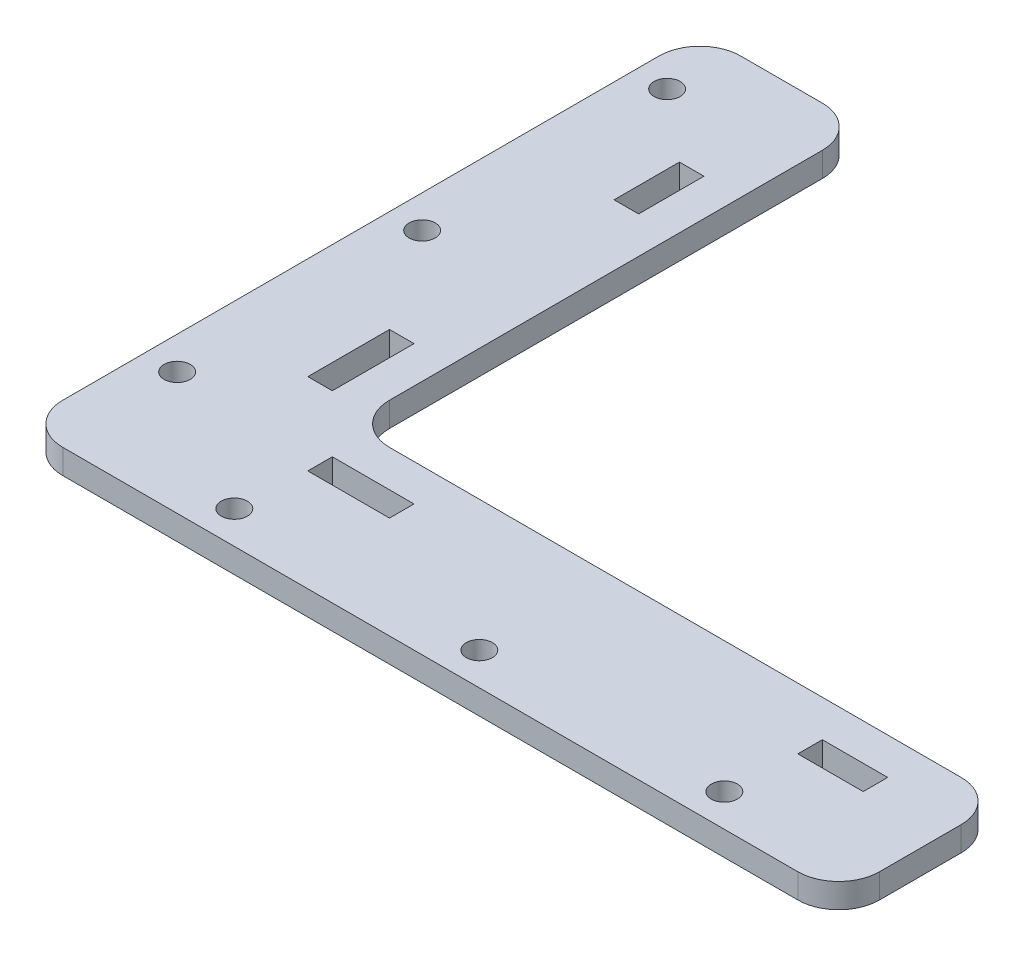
ISO-10303-21;
HEADER;
FILE_DESCRIPTION(('STEP AP214'),'2;1');
FILE_NAME('part.step','',(''),(''),'','','');
FILE_SCHEMA(('AUTOMOTIVE_DESIGN { 1 0 10303 214 1 1 1 1 }'));
ENDSEC;
DATA;
#1=APPLICATION_CONTEXT('core data for automotive mechanical design processes');
#2=APPLICATION_PROTOCOL_DEFINITION('international standard','automotive_design',2000,#1);
#3=PRODUCT_CONTEXT('',#1,'mechanical');
#4=PRODUCT('Part','Part','',(#3));
#5=PRODUCT_RELATED_PRODUCT_CATEGORY('part','',(#4));
#6=PRODUCT_DEFINITION_FORMATION('','',#4);
#7=PRODUCT_DEFINITION_CONTEXT('part definition',#1,'design');
#8=PRODUCT_DEFINITION('design','',#6,#7);
#9=PRODUCT_DEFINITION_SHAPE('','',#8);
#10=(LENGTH_UNIT() NAMED_UNIT(*) SI_UNIT(.MILLI.,.METRE.));
#11=(NAMED_UNIT(*) PLANE_ANGLE_UNIT() SI_UNIT($,.RADIAN.));
#12=(NAMED_UNIT(*) SI_UNIT($,.STERADIAN.) SOLID_ANGLE_UNIT());
#13=UNCERTAINTY_MEASURE_WITH_UNIT(LENGTH_MEASURE(1.E-05),#10,'distance_accuracy_value','');
#14=(GEOMETRIC_REPRESENTATION_CONTEXT(3) GLOBAL_UNCERTAINTY_ASSIGNED_CONTEXT((#13)) GLOBAL_UNIT_ASSIGNED_CONTEXT((#10,
#11,#12)) REPRESENTATION_CONTEXT('',''));
#15=CARTESIAN_POINT('',(0.,0.,0.));
#16=DIRECTION('',(0.,0.,1.));
#17=DIRECTION('',(1.,0.,0.));
#18=AXIS2_PLACEMENT_3D('',#15,#16,#17);
#19=CARTESIAN_POINT('',(-16.,0.,5.));
#20=DIRECTION('',(0.,1.,0.));
#21=DIRECTION('',(0.,0.,1.));
#22=AXIS2_PLACEMENT_3D('',#19,#20,#21);
#23=CYLINDRICAL_SURFACE('',#22,1.6);
#24=CARTESIAN_POINT('',(-16.,0.,5.));
#25=DIRECTION('',(0.,1.,0.));
#26=DIRECTION('',(0.,0.,1.));
#27=AXIS2_PLACEMENT_3D('',#24,#25,#26);
#28=CIRCLE('',#27,1.6);
#29=CARTESIAN_POINT('',(-16.,0.,6.6));
#30=VERTEX_POINT('',#29);
#31=EDGE_CURVE('E41',#30,#30,#28,.T.);
#32=ORIENTED_EDGE('',*,*,#31,.F.);
#33=EDGE_LOOP('',(#32));
#34=FACE_BOUND('',#33,.T.);
#35=CARTESIAN_POINT('',(-16.,3.,5.));
#36=DIRECTION('',(0.,1.,0.));
#37=DIRECTION('',(0.,0.,1.));
#38=AXIS2_PLACEMENT_3D('',#35,#36,#37);
#39=CIRCLE('',#38,1.6);
#40=CARTESIAN_POINT('',(-16.,3.,6.6));
#41=VERTEX_POINT('',#40);
#42=EDGE_CURVE('E11',#41,#41,#39,.T.);
#43=ORIENTED_EDGE('',*,*,#42,.T.);
#44=EDGE_LOOP('',(#43));
#45=FACE_BOUND('',#44,.T.);
#46=ADVANCED_FACE('F34',(#34,#45),#23,.F.);
#47=CARTESIAN_POINT('',(2.,0.,16.));
#48=DIRECTION('',(0.,1.,0.));
#49=DIRECTION('',(0.,0.,1.));
#50=AXIS2_PLACEMENT_3D('',#47,#48,#49);
#51=CYLINDRICAL_SURFACE('',#50,1.6);
#52=CARTESIAN_POINT('',(2.,0.,16.));
#53=DIRECTION('',(0.,1.,0.));
#54=DIRECTION('',(0.,0.,1.));
#55=AXIS2_PLACEMENT_3D('',#52,#53,#54);
#56=CIRCLE('',#55,1.6);
#57=CARTESIAN_POINT('',(2.,0.,17.6));
#58=VERTEX_POINT('',#57);
#59=EDGE_CURVE('E446',#58,#58,#56,.T.);
#60=ORIENTED_EDGE('',*,*,#59,.F.);
#61=EDGE_LOOP('',(#60));
#62=FACE_BOUND('',#61,.T.);
#63=CARTESIAN_POINT('',(2.,3.,16.));
#64=DIRECTION('',(0.,1.,0.));
#65=DIRECTION('',(0.,0.,1.));
#66=AXIS2_PLACEMENT_3D('',#63,#64,#65);
#67=CIRCLE('',#66,1.6);
#68=CARTESIAN_POINT('',(2.,3.,17.6));
#69=VERTEX_POINT('',#68);
#70=EDGE_CURVE('E449',#69,#69,#67,.T.);
#71=ORIENTED_EDGE('',*,*,#70,.T.);
#72=EDGE_LOOP('',(#71));
#73=FACE_BOUND('',#72,.T.);
#74=ADVANCED_FACE('F457',(#62,#73),#51,.F.);
#75=CARTESIAN_POINT('',(80.,3.,0.));
#76=DIRECTION('',(0.,0.,1.));
#77=DIRECTION('',(1.,0.,0.));
#78=AXIS2_PLACEMENT_3D('',#75,#76,#77);
#79=PLANE('',#78);
#80=DIRECTION('',(-1.,0.,0.));
#81=VECTOR('',#80,1.);
#82=CARTESIAN_POINT('',(80.,3.,0.));
#83=LINE('',#82,#81);
#84=CARTESIAN_POINT('',(75.,3.,0.));
#85=VERTEX_POINT('',#84);
#86=CARTESIAN_POINT('',(5.,3.,0.));
#87=VERTEX_POINT('',#86);
#88=EDGE_CURVE('E362',#85,#87,#83,.T.);
#89=ORIENTED_EDGE('',*,*,#88,.F.);
#90=DIRECTION('',(0.,-1.,0.));
#91=VECTOR('',#90,1.);
#92=CARTESIAN_POINT('',(75.,3.,0.));
#93=LINE('',#92,#91);
#94=CARTESIAN_POINT('',(75.,0.,0.));
#95=VERTEX_POINT('',#94);
#96=EDGE_CURVE('E396',#85,#95,#93,.T.);
#97=ORIENTED_EDGE('',*,*,#96,.T.);
#98=DIRECTION('',(-1.,0.,0.));
#99=VECTOR('',#98,1.);
#100=CARTESIAN_POINT('',(80.,0.,0.));
#101=LINE('',#100,#99);
#102=CARTESIAN_POINT('',(5.,0.,0.));
#103=VERTEX_POINT('',#102);
#104=EDGE_CURVE('E361',#95,#103,#101,.T.);
#105=ORIENTED_EDGE('',*,*,#104,.T.);
#106=DIRECTION('',(0.,-1.,0.));
#107=VECTOR('',#106,1.);
#108=CARTESIAN_POINT('',(5.,3.,0.));
#109=LINE('',#108,#107);
#110=EDGE_CURVE('E379',#103,#87,#109,.F.);
#111=ORIENTED_EDGE('',*,*,#110,.T.);
#112=EDGE_LOOP('',(#89,#97,#105,#111));
#113=FACE_BOUND('',#112,.T.);
#114=ADVANCED_FACE('F494',(#113),#79,.F.);
#115=CARTESIAN_POINT('',(0.,3.,0.));
#116=DIRECTION('',(-1.,0.,0.));
#117=DIRECTION('',(0.,0.,1.));
#118=AXIS2_PLACEMENT_3D('',#115,#116,#117);
#119=PLANE('',#118);
#120=DIRECTION('',(0.,0.,-1.));
#121=VECTOR('',#120,1.);
#122=CARTESIAN_POINT('',(0.,3.,0.));
#123=LINE('',#122,#121);
#124=CARTESIAN_POINT('',(0.,3.,-5.));
#125=VERTEX_POINT('',#124);
#126=CARTESIAN_POINT('',(0.,3.,-58.));
#127=VERTEX_POINT('',#126);
#128=EDGE_CURVE('E365',#125,#127,#123,.T.);
#129=ORIENTED_EDGE('',*,*,#128,.F.);
#130=DIRECTION('',(0.,-1.,0.));
#131=VECTOR('',#130,1.);
#132=CARTESIAN_POINT('',(0.,0.,-5.));
#133=LINE('',#132,#131);
#134=CARTESIAN_POINT('',(0.,0.,-5.));
#135=VERTEX_POINT('',#134);
#136=EDGE_CURVE('E434',#125,#135,#133,.T.);
#137=ORIENTED_EDGE('',*,*,#136,.T.);
#138=DIRECTION('',(0.,0.,-1.));
#139=VECTOR('',#138,1.);
#140=CARTESIAN_POINT('',(0.,0.,0.));
#141=LINE('',#140,#139);
#142=CARTESIAN_POINT('',(0.,0.,-58.));
#143=VERTEX_POINT('',#142);
#144=EDGE_CURVE('E382',#135,#143,#141,.T.);
#145=ORIENTED_EDGE('',*,*,#144,.T.);
#146=DIRECTION('',(0.,-1.,0.));
#147=VECTOR('',#146,1.);
#148=CARTESIAN_POINT('',(0.,3.,-58.));
#149=LINE('',#148,#147);
#150=EDGE_CURVE('E432',#143,#127,#149,.F.);
#151=ORIENTED_EDGE('',*,*,#150,.T.);
#152=EDGE_LOOP('',(#129,#137,#145,#151));
#153=FACE_BOUND('',#152,.T.);
#154=ADVANCED_FACE('F490',(#153),#119,.F.);
#155=CARTESIAN_POINT('',(0.,3.,-63.));
#156=DIRECTION('',(0.,0.,1.));
#157=DIRECTION('',(1.,0.,0.));
#158=AXIS2_PLACEMENT_3D('',#155,#156,#157);
#159=PLANE('',#158);
#160=DIRECTION('',(-1.,0.,0.));
#161=VECTOR('',#160,1.);
#162=CARTESIAN_POINT('',(0.,0.,-63.));
#163=LINE('',#162,#161);
#164=CARTESIAN_POINT('',(-5.,0.,-63.));
#165=VERTEX_POINT('',#164);
#166=CARTESIAN_POINT('',(-15.,0.,-63.));
#167=VERTEX_POINT('',#166);
#168=EDGE_CURVE('E385',#165,#167,#163,.T.);
#169=ORIENTED_EDGE('',*,*,#168,.T.);
#170=DIRECTION('',(0.,-1.,0.));
#171=VECTOR('',#170,1.);
#172=CARTESIAN_POINT('',(-15.,3.,-63.));
#173=LINE('',#172,#171);
#174=CARTESIAN_POINT('',(-15.,3.,-63.));
#175=VERTEX_POINT('',#174);
#176=EDGE_CURVE('E440',#167,#175,#173,.F.);
#177=ORIENTED_EDGE('',*,*,#176,.T.);
#178=DIRECTION('',(-1.,0.,0.));
#179=VECTOR('',#178,1.);
#180=CARTESIAN_POINT('',(0.,3.,-63.));
#181=LINE('',#180,#179);
#182=CARTESIAN_POINT('',(-5.,3.,-63.));
#183=VERTEX_POINT('',#182);
#184=EDGE_CURVE('E369',#183,#175,#181,.T.);
#185=ORIENTED_EDGE('',*,*,#184,.F.);
#186=DIRECTION('',(0.,-1.,0.));
#187=VECTOR('',#186,1.);
#188=CARTESIAN_POINT('',(-5.,3.,-63.));
#189=LINE('',#188,#187);
#190=EDGE_CURVE('E437',#183,#165,#189,.T.);
#191=ORIENTED_EDGE('',*,*,#190,.T.);
#192=EDGE_LOOP('',(#169,#177,#185,#191));
#193=FACE_BOUND('',#192,.T.);
#194=ADVANCED_FACE('F486',(#193),#159,.F.);
#195=CARTESIAN_POINT('',(-20.,3.,-63.));
#196=DIRECTION('',(1.,0.,0.));
#197=DIRECTION('',(0.,0.,-1.));
#198=AXIS2_PLACEMENT_3D('',#195,#196,#197);
#199=PLANE('',#198);
#200=DIRECTION('',(0.,0.,1.));
#201=VECTOR('',#200,1.);
#202=CARTESIAN_POINT('',(-20.,0.,-63.));
#203=LINE('',#202,#201);
#204=CARTESIAN_POINT('',(-20.,0.,-58.));
#205=VERTEX_POINT('',#204);
#206=CARTESIAN_POINT('',(-20.,0.,15.));
#207=VERTEX_POINT('',#206);
#208=EDGE_CURVE('E388',#205,#207,#203,.T.);
#209=ORIENTED_EDGE('',*,*,#208,.T.);
#210=DIRECTION('',(0.,-1.,0.));
#211=VECTOR('',#210,1.);
#212=CARTESIAN_POINT('',(-20.,3.,15.));
#213=LINE('',#212,#211);
#214=CARTESIAN_POINT('',(-20.,3.,15.));
#215=VERTEX_POINT('',#214);
#216=EDGE_CURVE('E430',#207,#215,#213,.F.);
#217=ORIENTED_EDGE('',*,*,#216,.T.);
#218=DIRECTION('',(0.,0.,1.));
#219=VECTOR('',#218,1.);
#220=CARTESIAN_POINT('',(-20.,3.,-63.));
#221=LINE('',#220,#219);
#222=CARTESIAN_POINT('',(-20.,3.,-58.));
#223=VERTEX_POINT('',#222);
#224=EDGE_CURVE('E372',#223,#215,#221,.T.);
#225=ORIENTED_EDGE('',*,*,#224,.F.);
#226=DIRECTION('',(0.,-1.,0.));
#227=VECTOR('',#226,1.);
#228=CARTESIAN_POINT('',(-20.,3.,-58.));
#229=LINE('',#228,#227);
#230=EDGE_CURVE('E427',#223,#205,#229,.T.);
#231=ORIENTED_EDGE('',*,*,#230,.T.);
#232=EDGE_LOOP('',(#209,#217,#225,#231));
#233=FACE_BOUND('',#232,.T.);
#234=ADVANCED_FACE('F483',(#233),#199,.F.);
#235=CARTESIAN_POINT('',(-20.,3.,20.));
#236=DIRECTION('',(0.,0.,-1.));
#237=DIRECTION('',(-1.,0.,0.));
#238=AXIS2_PLACEMENT_3D('',#235,#236,#237);
#239=PLANE('',#238);
#240=DIRECTION('',(1.,0.,0.));
#241=VECTOR('',#240,1.);
#242=CARTESIAN_POINT('',(-20.,0.,20.));
#243=LINE('',#242,#241);
#244=CARTESIAN_POINT('',(-15.,0.,20.));
#245=VERTEX_POINT('',#244);
#246=CARTESIAN_POINT('',(75.,0.,20.));
#247=VERTEX_POINT('',#246);
#248=EDGE_CURVE('E391',#245,#247,#243,.T.);
#249=ORIENTED_EDGE('',*,*,#248,.T.);
#250=DIRECTION('',(0.,-1.,0.));
#251=VECTOR('',#250,1.);
#252=CARTESIAN_POINT('',(75.,3.,20.));
#253=LINE('',#252,#251);
#254=CARTESIAN_POINT('',(75.,3.,20.));
#255=VERTEX_POINT('',#254);
#256=EDGE_CURVE('E48',#247,#255,#253,.F.);
#257=ORIENTED_EDGE('',*,*,#256,.T.);
#258=DIRECTION('',(1.,0.,0.));
#259=VECTOR('',#258,1.);
#260=CARTESIAN_POINT('',(-20.,3.,20.));
#261=LINE('',#260,#259);
#262=CARTESIAN_POINT('',(-15.,3.,20.));
#263=VERTEX_POINT('',#262);
#264=EDGE_CURVE('E374',#263,#255,#261,.T.);
#265=ORIENTED_EDGE('',*,*,#264,.F.);
#266=DIRECTION('',(0.,-1.,0.));
#267=VECTOR('',#266,1.);
#268=CARTESIAN_POINT('',(-15.,3.,20.));
#269=LINE('',#268,#267);
#270=EDGE_CURVE('E423',#263,#245,#269,.T.);
#271=ORIENTED_EDGE('',*,*,#270,.T.);
#272=EDGE_LOOP('',(#249,#257,#265,#271));
#273=FACE_BOUND('',#272,.T.);
#274=ADVANCED_FACE('F473',(#273),#239,.F.);
#275=CARTESIAN_POINT('',(80.,3.,20.));
#276=DIRECTION('',(-1.,0.,0.));
#277=DIRECTION('',(0.,0.,1.));
#278=AXIS2_PLACEMENT_3D('',#275,#276,#277);
#279=PLANE('',#278);
#280=DIRECTION('',(0.,0.,-1.));
#281=VECTOR('',#280,1.);
#282=CARTESIAN_POINT('',(80.,0.,20.));
#283=LINE('',#282,#281);
#284=CARTESIAN_POINT('',(80.,0.,15.));
#285=VERTEX_POINT('',#284);
#286=CARTESIAN_POINT('',(80.,0.,4.99999999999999));
#287=VERTEX_POINT('',#286);
#288=EDGE_CURVE('E366',#285,#287,#283,.T.);
#289=ORIENTED_EDGE('',*,*,#288,.T.);
#290=DIRECTION('',(0.,-1.,0.));
#291=VECTOR('',#290,1.);
#292=CARTESIAN_POINT('',(80.,3.,4.99999999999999));
#293=LINE('',#292,#291);
#294=CARTESIAN_POINT('',(80.,3.,4.99999999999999));
#295=VERTEX_POINT('',#294);
#296=EDGE_CURVE('E412',#287,#295,#293,.F.);
#297=ORIENTED_EDGE('',*,*,#296,.T.);
#298=DIRECTION('',(0.,0.,-1.));
#299=VECTOR('',#298,1.);
#300=CARTESIAN_POINT('',(80.,3.,20.));
#301=LINE('',#300,#299);
#302=CARTESIAN_POINT('',(80.,3.,15.));
#303=VERTEX_POINT('',#302);
#304=EDGE_CURVE('E376',#303,#295,#301,.T.);
#305=ORIENTED_EDGE('',*,*,#304,.F.);
#306=DIRECTION('',(0.,-1.,0.));
#307=VECTOR('',#306,1.);
#308=CARTESIAN_POINT('',(80.,3.,15.));
#309=LINE('',#308,#307);
#310=EDGE_CURVE('E409',#303,#285,#309,.T.);
#311=ORIENTED_EDGE('',*,*,#310,.T.);
#312=EDGE_LOOP('',(#289,#297,#305,#311));
#313=FACE_BOUND('',#312,.T.);
#314=ADVANCED_FACE('F462',(#313),#279,.F.);
#315=CARTESIAN_POINT('',(0.,3.,0.));
#316=DIRECTION('',(0.,-1.,0.));
#317=DIRECTION('',(0.,0.,-1.));
#318=AXIS2_PLACEMENT_3D('',#315,#316,#317);
#319=PLANE('',#318);
#320=CARTESIAN_POINT('',(-16.,3.,-25.));
#321=DIRECTION('',(0.,1.,0.));
#322=DIRECTION('',(0.,0.,1.));
#323=AXIS2_PLACEMENT_3D('',#320,#321,#322);
#324=CIRCLE('',#323,1.6);
#325=CARTESIAN_POINT('',(-16.,3.,-23.4));
#326=VERTEX_POINT('',#325);
#327=EDGE_CURVE('E834',#326,#326,#324,.T.);
#328=ORIENTED_EDGE('',*,*,#327,.F.);
#329=EDGE_LOOP('',(#328));
#330=FACE_BOUND('',#329,.T.);
#331=CARTESIAN_POINT('',(-16.,3.,-55.));
#332=DIRECTION('',(0.,1.,0.));
#333=DIRECTION('',(0.,0.,1.));
#334=AXIS2_PLACEMENT_3D('',#331,#332,#333);
#335=CIRCLE('',#334,1.6);
#336=CARTESIAN_POINT('',(-16.,3.,-53.4));
#337=VERTEX_POINT('',#336);
#338=EDGE_CURVE('E831',#337,#337,#335,.T.);
#339=ORIENTED_EDGE('',*,*,#338,.F.);
#340=EDGE_LOOP('',(#339));
#341=FACE_BOUND('',#340,.T.);
#342=CARTESIAN_POINT('',(32.,3.,16.));
#343=DIRECTION('',(0.,1.,0.));
#344=DIRECTION('',(0.,0.,1.));
#345=AXIS2_PLACEMENT_3D('',#342,#343,#344);
#346=CIRCLE('',#345,1.6);
#347=CARTESIAN_POINT('',(32.,3.,17.6));
#348=VERTEX_POINT('',#347);
#349=EDGE_CURVE('E822',#348,#348,#346,.T.);
#350=ORIENTED_EDGE('',*,*,#349,.F.);
#351=EDGE_LOOP('',(#350));
#352=FACE_BOUND('',#351,.T.);
#353=CARTESIAN_POINT('',(62.,3.,16.));
#354=DIRECTION('',(0.,1.,0.));
#355=DIRECTION('',(0.,0.,1.));
#356=AXIS2_PLACEMENT_3D('',#353,#354,#355);
#357=CIRCLE('',#356,1.6);
#358=CARTESIAN_POINT('',(62.,3.,17.6));
#359=VERTEX_POINT('',#358);
#360=EDGE_CURVE('E819',#359,#359,#357,.T.);
#361=ORIENTED_EDGE('',*,*,#360,.F.);
#362=EDGE_LOOP('',(#361));
#363=FACE_BOUND('',#362,.T.);
#364=DIRECTION('',(-1.,0.,0.));
#365=VECTOR('',#364,1.);
#366=CARTESIAN_POINT('',(0.,3.,7.50000000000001));
#367=LINE('',#366,#365);
#368=CARTESIAN_POINT('',(70.4999999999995,3.,7.50000000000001));
#369=VERTEX_POINT('',#368);
#370=CARTESIAN_POINT('',(62.4999999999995,3.,7.50000000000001));
#371=VERTEX_POINT('',#370);
#372=EDGE_CURVE('E323',#369,#371,#367,.T.);
#373=ORIENTED_EDGE('',*,*,#372,.T.);
#374=DIRECTION('',(0.,0.,-1.));
#375=VECTOR('',#374,1.);
#376=CARTESIAN_POINT('',(62.4999999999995,3.,0.));
#377=LINE('',#376,#375);
#378=CARTESIAN_POINT('',(62.4999999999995,3.,4.50000000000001));
#379=VERTEX_POINT('',#378);
#380=EDGE_CURVE('E326',#371,#379,#377,.T.);
#381=ORIENTED_EDGE('',*,*,#380,.T.);
#382=DIRECTION('',(1.,0.,0.));
#383=VECTOR('',#382,1.);
#384=CARTESIAN_POINT('',(0.,3.,4.50000000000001));
#385=LINE('',#384,#383);
#386=CARTESIAN_POINT('',(70.4999999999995,3.,4.50000000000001));
#387=VERTEX_POINT('',#386);
#388=EDGE_CURVE('E320',#379,#387,#385,.T.);
#389=ORIENTED_EDGE('',*,*,#388,.T.);
#390=DIRECTION('',(0.,0.,1.));
#391=VECTOR('',#390,1.);
#392=CARTESIAN_POINT('',(70.4999999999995,3.,0.));
#393=LINE('',#392,#391);
#394=EDGE_CURVE('E228',#387,#369,#393,.T.);
#395=ORIENTED_EDGE('',*,*,#394,.T.);
#396=EDGE_LOOP('',(#373,#381,#389,#395));
#397=FACE_BOUND('',#396,.T.);
#398=DIRECTION('',(-1.,0.,0.));
#399=VECTOR('',#398,1.);
#400=CARTESIAN_POINT('',(0.,3.,-2.5));
#401=LINE('',#400,#399);
#402=CARTESIAN_POINT('',(-4.50000000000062,3.,-2.5));
#403=VERTEX_POINT('',#402);
#404=CARTESIAN_POINT('',(-7.50000000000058,3.,-2.5));
#405=VERTEX_POINT('',#404);
#406=EDGE_CURVE('E314',#403,#405,#401,.T.);
#407=ORIENTED_EDGE('',*,*,#406,.T.);
#408=DIRECTION('',(0.,0.,-1.));
#409=VECTOR('',#408,1.);
#410=CARTESIAN_POINT('',(-7.50000000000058,3.,0.));
#411=LINE('',#410,#409);
#412=CARTESIAN_POINT('',(-7.50000000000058,3.,-12.5));
#413=VERTEX_POINT('',#412);
#414=EDGE_CURVE('E317',#405,#413,#411,.T.);
#415=ORIENTED_EDGE('',*,*,#414,.T.);
#416=DIRECTION('',(1.,0.,0.));
#417=VECTOR('',#416,1.);
#418=CARTESIAN_POINT('',(0.,3.,-12.5));
#419=LINE('',#418,#417);
#420=CARTESIAN_POINT('',(-4.50000000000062,3.,-12.5));
#421=VERTEX_POINT('',#420);
#422=EDGE_CURVE('E308',#413,#421,#419,.T.);
#423=ORIENTED_EDGE('',*,*,#422,.T.);
#424=DIRECTION('',(0.,0.,1.));
#425=VECTOR('',#424,1.);
#426=CARTESIAN_POINT('',(-4.50000000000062,3.,0.));
#427=LINE('',#426,#425);
#428=EDGE_CURVE('E311',#421,#403,#427,.T.);
#429=ORIENTED_EDGE('',*,*,#428,.T.);
#430=EDGE_LOOP('',(#407,#415,#423,#429));
#431=FACE_BOUND('',#430,.T.);
#432=DIRECTION('',(-1.,0.,0.));
#433=VECTOR('',#432,1.);
#434=CARTESIAN_POINT('',(0.,3.,-40.));
#435=LINE('',#434,#433);
#436=CARTESIAN_POINT('',(-4.50000000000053,3.,-40.));
#437=VERTEX_POINT('',#436);
#438=CARTESIAN_POINT('',(-7.50000000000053,3.,-40.));
#439=VERTEX_POINT('',#438);
#440=EDGE_CURVE('E302',#437,#439,#435,.T.);
#441=ORIENTED_EDGE('',*,*,#440,.T.);
#442=DIRECTION('',(0.,0.,-1.));
#443=VECTOR('',#442,1.);
#444=CARTESIAN_POINT('',(-7.50000000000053,3.,0.));
#445=LINE('',#444,#443);
#446=CARTESIAN_POINT('',(-7.50000000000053,3.,-48.));
#447=VERTEX_POINT('',#446);
#448=EDGE_CURVE('E305',#439,#447,#445,.T.);
#449=ORIENTED_EDGE('',*,*,#448,.T.);
#450=DIRECTION('',(1.,0.,0.));
#451=VECTOR('',#450,1.);
#452=CARTESIAN_POINT('',(0.,3.,-48.));
#453=LINE('',#452,#451);
#454=CARTESIAN_POINT('',(-4.50000000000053,3.,-48.));
#455=VERTEX_POINT('',#454);
#456=EDGE_CURVE('E253',#447,#455,#453,.T.);
#457=ORIENTED_EDGE('',*,*,#456,.T.);
#458=DIRECTION('',(0.,0.,1.));
#459=VECTOR('',#458,1.);
#460=CARTESIAN_POINT('',(-4.50000000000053,3.,0.));
#461=LINE('',#460,#459);
#462=EDGE_CURVE('E299',#455,#437,#461,.T.);
#463=ORIENTED_EDGE('',*,*,#462,.T.);
#464=EDGE_LOOP('',(#441,#449,#457,#463));
#465=FACE_BOUND('',#464,.T.);
#466=DIRECTION('',(-1.,0.,0.));
#467=VECTOR('',#466,1.);
#468=CARTESIAN_POINT('',(0.,3.,7.5));
#469=LINE('',#468,#467);
#470=CARTESIAN_POINT('',(12.4999999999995,3.,7.5));
#471=VERTEX_POINT('',#470);
#472=CARTESIAN_POINT('',(2.4999999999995,3.,7.5));
#473=VERTEX_POINT('',#472);
#474=EDGE_CURVE('E355',#471,#473,#469,.T.);
#475=ORIENTED_EDGE('',*,*,#474,.T.);
#476=DIRECTION('',(0.,0.,-1.));
#477=VECTOR('',#476,1.);
#478=CARTESIAN_POINT('',(2.4999999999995,3.,0.));
#479=LINE('',#478,#477);
#480=CARTESIAN_POINT('',(2.4999999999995,3.,4.5));
#481=VERTEX_POINT('',#480);
#482=EDGE_CURVE('E358',#473,#481,#479,.T.);
#483=ORIENTED_EDGE('',*,*,#482,.T.);
#484=DIRECTION('',(1.,0.,0.));
#485=VECTOR('',#484,1.);
#486=CARTESIAN_POINT('',(0.,3.,4.5));
#487=LINE('',#486,#485);
#488=CARTESIAN_POINT('',(12.4999999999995,3.,4.5));
#489=VERTEX_POINT('',#488);
#490=EDGE_CURVE('E343',#481,#489,#487,.T.);
#491=ORIENTED_EDGE('',*,*,#490,.T.);
#492=DIRECTION('',(0.,0.,1.));
#493=VECTOR('',#492,1.);
#494=CARTESIAN_POINT('',(12.4999999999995,3.,0.));
#495=LINE('',#494,#493);
#496=EDGE_CURVE('E352',#489,#471,#495,.T.);
#497=ORIENTED_EDGE('',*,*,#496,.T.);
#498=EDGE_LOOP('',(#475,#483,#491,#497));
#499=FACE_BOUND('',#498,.T.);
#500=ORIENTED_EDGE('',*,*,#304,.T.);
#501=CARTESIAN_POINT('',(75.,3.,4.99999999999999));
#502=DIRECTION('',(0.,-1.,0.));
#503=DIRECTION('',(0.,0.,-1.));
#504=AXIS2_PLACEMENT_3D('',#501,#502,#503);
#505=CIRCLE('',#504,5.);
#506=EDGE_CURVE('E421',#295,#85,#505,.F.);
#507=ORIENTED_EDGE('',*,*,#506,.T.);
#508=ORIENTED_EDGE('',*,*,#88,.T.);
#509=CARTESIAN_POINT('',(5.,3.,-5.));
#510=DIRECTION('',(0.,-1.,0.));
#511=DIRECTION('',(0.,0.,-1.));
#512=AXIS2_PLACEMENT_3D('',#509,#510,#511);
#513=CIRCLE('',#512,5.);
#514=EDGE_CURVE('E444',#87,#125,#513,.T.);
#515=ORIENTED_EDGE('',*,*,#514,.T.);
#516=ORIENTED_EDGE('',*,*,#128,.T.);
#517=CARTESIAN_POINT('',(-5.,3.,-58.));
#518=DIRECTION('',(0.,-1.,0.));
#519=DIRECTION('',(0.,0.,-1.));
#520=AXIS2_PLACEMENT_3D('',#517,#518,#519);
#521=CIRCLE('',#520,5.);
#522=EDGE_CURVE('E414',#127,#183,#521,.F.);
#523=ORIENTED_EDGE('',*,*,#522,.T.);
#524=ORIENTED_EDGE('',*,*,#184,.T.);
#525=CARTESIAN_POINT('',(-15.,3.,-58.));
#526=DIRECTION('',(0.,-1.,0.));
#527=DIRECTION('',(0.,0.,-1.));
#528=AXIS2_PLACEMENT_3D('',#525,#526,#527);
#529=CIRCLE('',#528,5.);
#530=EDGE_CURVE('E416',#175,#223,#529,.F.);
#531=ORIENTED_EDGE('',*,*,#530,.T.);
#532=ORIENTED_EDGE('',*,*,#224,.T.);
#533=CARTESIAN_POINT('',(-15.,3.,15.));
#534=DIRECTION('',(0.,-1.,0.));
#535=DIRECTION('',(0.,0.,-1.));
#536=AXIS2_PLACEMENT_3D('',#533,#534,#535);
#537=CIRCLE('',#536,5.);
#538=EDGE_CURVE('E55',#215,#263,#537,.F.);
#539=ORIENTED_EDGE('',*,*,#538,.T.);
#540=ORIENTED_EDGE('',*,*,#264,.T.);
#541=CARTESIAN_POINT('',(75.,3.,15.));
#542=DIRECTION('',(0.,-1.,0.));
#543=DIRECTION('',(0.,0.,-1.));
#544=AXIS2_PLACEMENT_3D('',#541,#542,#543);
#545=CIRCLE('',#544,5.);
#546=EDGE_CURVE('E419',#255,#303,#545,.F.);
#547=ORIENTED_EDGE('',*,*,#546,.T.);
#548=EDGE_LOOP('',(#500,#507,#508,#515,#516,#523,#524,#531,#532,#539,#540,#547));
#549=FACE_BOUND('',#548,.T.);
#550=ORIENTED_EDGE('',*,*,#70,.F.);
#551=EDGE_LOOP('',(#550));
#552=FACE_BOUND('',#551,.T.);
#553=ORIENTED_EDGE('',*,*,#42,.F.);
#554=EDGE_LOOP('',(#553));
#555=FACE_BOUND('',#554,.T.);
#556=ADVANCED_FACE('F460',(#330,#341,#352,#363,#397,#431,#465,#499,#549,#552,#555),#319,.F.);
#557=CARTESIAN_POINT('',(0.,0.,0.));
#558=DIRECTION('',(0.,-1.,0.));
#559=DIRECTION('',(0.,0.,-1.));
#560=AXIS2_PLACEMENT_3D('',#557,#558,#559);
#561=PLANE('',#560);
#562=CARTESIAN_POINT('',(-16.,0.,-25.));
#563=DIRECTION('',(0.,1.,0.));
#564=DIRECTION('',(0.,0.,1.));
#565=AXIS2_PLACEMENT_3D('',#562,#563,#564);
#566=CIRCLE('',#565,1.6);
#567=CARTESIAN_POINT('',(-16.,0.,-23.4));
#568=VERTEX_POINT('',#567);
#569=EDGE_CURVE('E839',#568,#568,#566,.T.);
#570=ORIENTED_EDGE('',*,*,#569,.T.);
#571=EDGE_LOOP('',(#570));
#572=FACE_BOUND('',#571,.T.);
#573=CARTESIAN_POINT('',(-16.,0.,-55.));
#574=DIRECTION('',(0.,1.,0.));
#575=DIRECTION('',(0.,0.,1.));
#576=AXIS2_PLACEMENT_3D('',#573,#574,#575);
#577=CIRCLE('',#576,1.6);
#578=CARTESIAN_POINT('',(-16.,0.,-53.4));
#579=VERTEX_POINT('',#578);
#580=EDGE_CURVE('E830',#579,#579,#577,.T.);
#581=ORIENTED_EDGE('',*,*,#580,.T.);
#582=EDGE_LOOP('',(#581));
#583=FACE_BOUND('',#582,.T.);
#584=CARTESIAN_POINT('',(32.,0.,16.));
#585=DIRECTION('',(0.,1.,0.));
#586=DIRECTION('',(0.,0.,1.));
#587=AXIS2_PLACEMENT_3D('',#584,#585,#586);
#588=CIRCLE('',#587,1.6);
#589=CARTESIAN_POINT('',(32.,0.,17.6));
#590=VERTEX_POINT('',#589);
#591=EDGE_CURVE('E827',#590,#590,#588,.T.);
#592=ORIENTED_EDGE('',*,*,#591,.T.);
#593=EDGE_LOOP('',(#592));
#594=FACE_BOUND('',#593,.T.);
#595=CARTESIAN_POINT('',(62.,0.,16.));
#596=DIRECTION('',(0.,1.,0.));
#597=DIRECTION('',(0.,0.,1.));
#598=AXIS2_PLACEMENT_3D('',#595,#596,#597);
#599=CIRCLE('',#598,1.6);
#600=CARTESIAN_POINT('',(62.,0.,17.6));
#601=VERTEX_POINT('',#600);
#602=EDGE_CURVE('E280',#601,#601,#599,.T.);
#603=ORIENTED_EDGE('',*,*,#602,.T.);
#604=EDGE_LOOP('',(#603));
#605=FACE_BOUND('',#604,.T.);
#606=DIRECTION('',(0.,0.,-1.));
#607=VECTOR('',#606,1.);
#608=CARTESIAN_POINT('',(62.4999999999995,0.,7.50000000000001));
#609=LINE('',#608,#607);
#610=CARTESIAN_POINT('',(62.4999999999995,0.,7.50000000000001));
#611=VERTEX_POINT('',#610);
#612=CARTESIAN_POINT('',(62.4999999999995,0.,4.50000000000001));
#613=VERTEX_POINT('',#612);
#614=EDGE_CURVE('E241',#611,#613,#609,.T.);
#615=ORIENTED_EDGE('',*,*,#614,.F.);
#616=DIRECTION('',(-1.,0.,0.));
#617=VECTOR('',#616,1.);
#618=CARTESIAN_POINT('',(62.4999999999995,0.,7.50000000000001));
#619=LINE('',#618,#617);
#620=CARTESIAN_POINT('',(70.4999999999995,0.,7.50000000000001));
#621=VERTEX_POINT('',#620);
#622=EDGE_CURVE('E246',#621,#611,#619,.T.);
#623=ORIENTED_EDGE('',*,*,#622,.F.);
#624=DIRECTION('',(0.,0.,1.));
#625=VECTOR('',#624,1.);
#626=CARTESIAN_POINT('',(70.4999999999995,0.,7.50000000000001));
#627=LINE('',#626,#625);
#628=CARTESIAN_POINT('',(70.4999999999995,0.,4.50000000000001));
#629=VERTEX_POINT('',#628);
#630=EDGE_CURVE('E225',#629,#621,#627,.T.);
#631=ORIENTED_EDGE('',*,*,#630,.F.);
#632=DIRECTION('',(1.,0.,0.));
#633=VECTOR('',#632,1.);
#634=CARTESIAN_POINT('',(62.4999999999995,0.,4.50000000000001));
#635=LINE('',#634,#633);
#636=EDGE_CURVE('E236',#613,#629,#635,.T.);
#637=ORIENTED_EDGE('',*,*,#636,.F.);
#638=EDGE_LOOP('',(#615,#623,#631,#637));
#639=FACE_BOUND('',#638,.T.);
#640=DIRECTION('',(0.,0.,-1.));
#641=VECTOR('',#640,1.);
#642=CARTESIAN_POINT('',(-7.50000000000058,0.,-2.5));
#643=LINE('',#642,#641);
#644=CARTESIAN_POINT('',(-7.50000000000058,0.,-2.5));
#645=VERTEX_POINT('',#644);
#646=CARTESIAN_POINT('',(-7.50000000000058,0.,-12.5));
#647=VERTEX_POINT('',#646);
#648=EDGE_CURVE('E256',#645,#647,#643,.T.);
#649=ORIENTED_EDGE('',*,*,#648,.F.);
#650=DIRECTION('',(-1.,0.,0.));
#651=VECTOR('',#650,1.);
#652=CARTESIAN_POINT('',(-7.50000000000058,0.,-2.5));
#653=LINE('',#652,#651);
#654=CARTESIAN_POINT('',(-4.50000000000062,0.,-2.5));
#655=VERTEX_POINT('',#654);
#656=EDGE_CURVE('E265',#655,#645,#653,.T.);
#657=ORIENTED_EDGE('',*,*,#656,.F.);
#658=DIRECTION('',(0.,0.,1.));
#659=VECTOR('',#658,1.);
#660=CARTESIAN_POINT('',(-4.50000000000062,0.,-2.5));
#661=LINE('',#660,#659);
#662=CARTESIAN_POINT('',(-4.50000000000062,0.,-12.5));
#663=VERTEX_POINT('',#662);
#664=EDGE_CURVE('E262',#663,#655,#661,.T.);
#665=ORIENTED_EDGE('',*,*,#664,.F.);
#666=DIRECTION('',(1.,0.,0.));
#667=VECTOR('',#666,1.);
#668=CARTESIAN_POINT('',(-7.50000000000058,0.,-12.5));
#669=LINE('',#668,#667);
#670=EDGE_CURVE('E258',#647,#663,#669,.T.);
#671=ORIENTED_EDGE('',*,*,#670,.F.);
#672=EDGE_LOOP('',(#649,#657,#665,#671));
#673=FACE_BOUND('',#672,.T.);
#674=DIRECTION('',(0.,0.,-1.));
#675=VECTOR('',#674,1.);
#676=CARTESIAN_POINT('',(-7.50000000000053,0.,-40.));
#677=LINE('',#676,#675);
#678=CARTESIAN_POINT('',(-7.50000000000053,0.,-40.));
#679=VERTEX_POINT('',#678);
#680=CARTESIAN_POINT('',(-7.50000000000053,0.,-48.));
#681=VERTEX_POINT('',#680);
#682=EDGE_CURVE('E277',#679,#681,#677,.T.);
#683=ORIENTED_EDGE('',*,*,#682,.F.);
#684=DIRECTION('',(-1.,0.,0.));
#685=VECTOR('',#684,1.);
#686=CARTESIAN_POINT('',(-7.50000000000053,0.,-40.));
#687=LINE('',#686,#685);
#688=CARTESIAN_POINT('',(-4.50000000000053,0.,-40.));
#689=VERTEX_POINT('',#688);
#690=EDGE_CURVE('E286',#689,#679,#687,.T.);
#691=ORIENTED_EDGE('',*,*,#690,.F.);
#692=DIRECTION('',(0.,0.,1.));
#693=VECTOR('',#692,1.);
#694=CARTESIAN_POINT('',(-4.50000000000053,0.,-40.));
#695=LINE('',#694,#693);
#696=CARTESIAN_POINT('',(-4.50000000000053,0.,-48.));
#697=VERTEX_POINT('',#696);
#698=EDGE_CURVE('E283',#697,#689,#695,.T.);
#699=ORIENTED_EDGE('',*,*,#698,.F.);
#700=DIRECTION('',(1.,0.,0.));
#701=VECTOR('',#700,1.);
#702=CARTESIAN_POINT('',(-7.50000000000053,0.,-48.));
#703=LINE('',#702,#701);
#704=EDGE_CURVE('E279',#681,#697,#703,.T.);
#705=ORIENTED_EDGE('',*,*,#704,.F.);
#706=EDGE_LOOP('',(#683,#691,#699,#705));
#707=FACE_BOUND('',#706,.T.);
#708=DIRECTION('',(0.,0.,-1.));
#709=VECTOR('',#708,1.);
#710=CARTESIAN_POINT('',(2.4999999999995,0.,7.5));
#711=LINE('',#710,#709);
#712=CARTESIAN_POINT('',(2.4999999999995,0.,7.5));
#713=VERTEX_POINT('',#712);
#714=CARTESIAN_POINT('',(2.4999999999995,0.,4.5));
#715=VERTEX_POINT('',#714);
#716=EDGE_CURVE('E329',#713,#715,#711,.T.);
#717=ORIENTED_EDGE('',*,*,#716,.F.);
#718=DIRECTION('',(-1.,0.,0.));
#719=VECTOR('',#718,1.);
#720=CARTESIAN_POINT('',(2.4999999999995,0.,7.5));
#721=LINE('',#720,#719);
#722=CARTESIAN_POINT('',(12.4999999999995,0.,7.5));
#723=VERTEX_POINT('',#722);
#724=EDGE_CURVE('E337',#723,#713,#721,.T.);
#725=ORIENTED_EDGE('',*,*,#724,.F.);
#726=DIRECTION('',(0.,0.,1.));
#727=VECTOR('',#726,1.);
#728=CARTESIAN_POINT('',(12.4999999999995,0.,7.5));
#729=LINE('',#728,#727);
#730=CARTESIAN_POINT('',(12.4999999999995,0.,4.5));
#731=VERTEX_POINT('',#730);
#732=EDGE_CURVE('E334',#731,#723,#729,.T.);
#733=ORIENTED_EDGE('',*,*,#732,.F.);
#734=DIRECTION('',(1.,0.,0.));
#735=VECTOR('',#734,1.);
#736=CARTESIAN_POINT('',(2.4999999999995,0.,4.5));
#737=LINE('',#736,#735);
#738=EDGE_CURVE('E331',#715,#731,#737,.T.);
#739=ORIENTED_EDGE('',*,*,#738,.F.);
#740=EDGE_LOOP('',(#717,#725,#733,#739));
#741=FACE_BOUND('',#740,.T.);
#742=ORIENTED_EDGE('',*,*,#104,.F.);
#743=CARTESIAN_POINT('',(75.,0.,4.99999999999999));
#744=DIRECTION('',(0.,-1.,0.));
#745=DIRECTION('',(0.,0.,-1.));
#746=AXIS2_PLACEMENT_3D('',#743,#744,#745);
#747=CIRCLE('',#746,5.);
#748=EDGE_CURVE('E407',#95,#287,#747,.T.);
#749=ORIENTED_EDGE('',*,*,#748,.T.);
#750=ORIENTED_EDGE('',*,*,#288,.F.);
#751=CARTESIAN_POINT('',(75.,0.,15.));
#752=DIRECTION('',(0.,-1.,0.));
#753=DIRECTION('',(0.,0.,-1.));
#754=AXIS2_PLACEMENT_3D('',#751,#752,#753);
#755=CIRCLE('',#754,5.);
#756=EDGE_CURVE('E405',#285,#247,#755,.T.);
#757=ORIENTED_EDGE('',*,*,#756,.T.);
#758=ORIENTED_EDGE('',*,*,#248,.F.);
#759=CARTESIAN_POINT('',(-15.,0.,15.));
#760=DIRECTION('',(0.,-1.,0.));
#761=DIRECTION('',(0.,0.,-1.));
#762=AXIS2_PLACEMENT_3D('',#759,#760,#761);
#763=CIRCLE('',#762,5.);
#764=EDGE_CURVE('E403',#245,#207,#763,.T.);
#765=ORIENTED_EDGE('',*,*,#764,.T.);
#766=ORIENTED_EDGE('',*,*,#208,.F.);
#767=CARTESIAN_POINT('',(-15.,0.,-58.));
#768=DIRECTION('',(0.,-1.,0.));
#769=DIRECTION('',(0.,0.,-1.));
#770=AXIS2_PLACEMENT_3D('',#767,#768,#769);
#771=CIRCLE('',#770,5.);
#772=EDGE_CURVE('E401',#205,#167,#771,.T.);
#773=ORIENTED_EDGE('',*,*,#772,.T.);
#774=ORIENTED_EDGE('',*,*,#168,.F.);
#775=CARTESIAN_POINT('',(-5.,0.,-58.));
#776=DIRECTION('',(0.,-1.,0.));
#777=DIRECTION('',(0.,0.,-1.));
#778=AXIS2_PLACEMENT_3D('',#775,#776,#777);
#779=CIRCLE('',#778,5.);
#780=EDGE_CURVE('E399',#165,#143,#779,.T.);
#781=ORIENTED_EDGE('',*,*,#780,.T.);
#782=ORIENTED_EDGE('',*,*,#144,.F.);
#783=CARTESIAN_POINT('',(5.,0.,-5.));
#784=DIRECTION('',(0.,-1.,0.));
#785=DIRECTION('',(0.,0.,-1.));
#786=AXIS2_PLACEMENT_3D('',#783,#784,#785);
#787=CIRCLE('',#786,5.);
#788=EDGE_CURVE('E442',#135,#103,#787,.F.);
#789=ORIENTED_EDGE('',*,*,#788,.T.);
#790=EDGE_LOOP('',(#742,#749,#750,#757,#758,#765,#766,#773,#774,#781,#782,#789));
#791=FACE_BOUND('',#790,.T.);
#792=ORIENTED_EDGE('',*,*,#59,.T.);
#793=EDGE_LOOP('',(#792));
#794=FACE_BOUND('',#793,.T.);
#795=ORIENTED_EDGE('',*,*,#31,.T.);
#796=EDGE_LOOP('',(#795));
#797=FACE_BOUND('',#796,.T.);
#798=ADVANCED_FACE('F243',(#572,#583,#594,#605,#639,#673,#707,#741,#791,#794,#797),#561,.T.);
#799=CARTESIAN_POINT('',(2.4999999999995,10.,7.5));
#800=DIRECTION('',(-1.,0.,0.));
#801=DIRECTION('',(0.,0.,1.));
#802=AXIS2_PLACEMENT_3D('',#799,#800,#801);
#803=PLANE('',#802);
#804=DIRECTION('',(0.,-1.,0.));
#805=VECTOR('',#804,1.);
#806=CARTESIAN_POINT('',(2.4999999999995,10.,7.5));
#807=LINE('',#806,#805);
#808=EDGE_CURVE('E341',#473,#713,#807,.T.);
#809=ORIENTED_EDGE('',*,*,#808,.T.);
#810=ORIENTED_EDGE('',*,*,#716,.T.);
#811=DIRECTION('',(0.,-1.,0.));
#812=VECTOR('',#811,1.);
#813=CARTESIAN_POINT('',(2.4999999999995,10.,4.5));
#814=LINE('',#813,#812);
#815=EDGE_CURVE('E340',#481,#715,#814,.T.);
#816=ORIENTED_EDGE('',*,*,#815,.F.);
#817=ORIENTED_EDGE('',*,*,#482,.F.);
#818=EDGE_LOOP('',(#809,#810,#816,#817));
#819=FACE_BOUND('',#818,.T.);
#820=ADVANCED_FACE('F469',(#819),#803,.F.);
#821=CARTESIAN_POINT('',(2.4999999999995,10.,7.5));
#822=DIRECTION('',(0.,0.,1.));
#823=DIRECTION('',(1.,0.,0.));
#824=AXIS2_PLACEMENT_3D('',#821,#822,#823);
#825=PLANE('',#824);
#826=DIRECTION('',(0.,-1.,0.));
#827=VECTOR('',#826,1.);
#828=CARTESIAN_POINT('',(12.4999999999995,10.,7.5));
#829=LINE('',#828,#827);
#830=EDGE_CURVE('E344',#471,#723,#829,.T.);
#831=ORIENTED_EDGE('',*,*,#830,.T.);
#832=ORIENTED_EDGE('',*,*,#724,.T.);
#833=ORIENTED_EDGE('',*,*,#808,.F.);
#834=ORIENTED_EDGE('',*,*,#474,.F.);
#835=EDGE_LOOP('',(#831,#832,#833,#834));
#836=FACE_BOUND('',#835,.T.);
#837=ADVANCED_FACE('F583',(#836),#825,.F.);
#838=CARTESIAN_POINT('',(12.4999999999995,10.,7.5));
#839=DIRECTION('',(1.,0.,0.));
#840=DIRECTION('',(0.,0.,-1.));
#841=AXIS2_PLACEMENT_3D('',#838,#839,#840);
#842=PLANE('',#841);
#843=DIRECTION('',(0.,-1.,0.));
#844=VECTOR('',#843,1.);
#845=CARTESIAN_POINT('',(12.4999999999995,10.,4.5));
#846=LINE('',#845,#844);
#847=EDGE_CURVE('E346',#489,#731,#846,.T.);
#848=ORIENTED_EDGE('',*,*,#847,.T.);
#849=ORIENTED_EDGE('',*,*,#732,.T.);
#850=ORIENTED_EDGE('',*,*,#830,.F.);
#851=ORIENTED_EDGE('',*,*,#496,.F.);
#852=EDGE_LOOP('',(#848,#849,#850,#851));
#853=FACE_BOUND('',#852,.T.);
#854=ADVANCED_FACE('F589',(#853),#842,.F.);
#855=CARTESIAN_POINT('',(2.4999999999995,10.,4.5));
#856=DIRECTION('',(0.,0.,-1.));
#857=DIRECTION('',(-1.,0.,0.));
#858=AXIS2_PLACEMENT_3D('',#855,#856,#857);
#859=PLANE('',#858);
#860=ORIENTED_EDGE('',*,*,#815,.T.);
#861=ORIENTED_EDGE('',*,*,#738,.T.);
#862=ORIENTED_EDGE('',*,*,#847,.F.);
#863=ORIENTED_EDGE('',*,*,#490,.F.);
#864=EDGE_LOOP('',(#860,#861,#862,#863));
#865=FACE_BOUND('',#864,.T.);
#866=ADVANCED_FACE('F597',(#865),#859,.F.);
#867=CARTESIAN_POINT('',(-7.50000000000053,10.,-40.));
#868=DIRECTION('',(-1.,0.,0.));
#869=DIRECTION('',(0.,0.,1.));
#870=AXIS2_PLACEMENT_3D('',#867,#868,#869);
#871=PLANE('',#870);
#872=DIRECTION('',(0.,-1.,0.));
#873=VECTOR('',#872,1.);
#874=CARTESIAN_POINT('',(-7.50000000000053,10.,-40.));
#875=LINE('',#874,#873);
#876=EDGE_CURVE('E259',#439,#679,#875,.T.);
#877=ORIENTED_EDGE('',*,*,#876,.T.);
#878=ORIENTED_EDGE('',*,*,#682,.T.);
#879=DIRECTION('',(0.,-1.,0.));
#880=VECTOR('',#879,1.);
#881=CARTESIAN_POINT('',(-7.50000000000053,10.,-48.));
#882=LINE('',#881,#880);
#883=EDGE_CURVE('E289',#447,#681,#882,.T.);
#884=ORIENTED_EDGE('',*,*,#883,.F.);
#885=ORIENTED_EDGE('',*,*,#448,.F.);
#886=EDGE_LOOP('',(#877,#878,#884,#885));
#887=FACE_BOUND('',#886,.T.);
#888=ADVANCED_FACE('F605',(#887),#871,.F.);
#889=CARTESIAN_POINT('',(-7.50000000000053,10.,-40.));
#890=DIRECTION('',(0.,0.,1.));
#891=DIRECTION('',(1.,0.,0.));
#892=AXIS2_PLACEMENT_3D('',#889,#890,#891);
#893=PLANE('',#892);
#894=DIRECTION('',(0.,-1.,0.));
#895=VECTOR('',#894,1.);
#896=CARTESIAN_POINT('',(-4.50000000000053,10.,-40.));
#897=LINE('',#896,#895);
#898=EDGE_CURVE('E291',#437,#689,#897,.T.);
#899=ORIENTED_EDGE('',*,*,#898,.T.);
#900=ORIENTED_EDGE('',*,*,#690,.T.);
#901=ORIENTED_EDGE('',*,*,#876,.F.);
#902=ORIENTED_EDGE('',*,*,#440,.F.);
#903=EDGE_LOOP('',(#899,#900,#901,#902));
#904=FACE_BOUND('',#903,.T.);
#905=ADVANCED_FACE('F612',(#904),#893,.F.);
#906=CARTESIAN_POINT('',(-4.50000000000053,10.,-40.));
#907=DIRECTION('',(1.,0.,0.));
#908=DIRECTION('',(0.,0.,-1.));
#909=AXIS2_PLACEMENT_3D('',#906,#907,#908);
#910=PLANE('',#909);
#911=DIRECTION('',(0.,-1.,0.));
#912=VECTOR('',#911,1.);
#913=CARTESIAN_POINT('',(-4.50000000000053,10.,-48.));
#914=LINE('',#913,#912);
#915=EDGE_CURVE('E293',#455,#697,#914,.T.);
#916=ORIENTED_EDGE('',*,*,#915,.T.);
#917=ORIENTED_EDGE('',*,*,#698,.T.);
#918=ORIENTED_EDGE('',*,*,#898,.F.);
#919=ORIENTED_EDGE('',*,*,#462,.F.);
#920=EDGE_LOOP('',(#916,#917,#918,#919));
#921=FACE_BOUND('',#920,.T.);
#922=ADVANCED_FACE('F620',(#921),#910,.F.);
#923=CARTESIAN_POINT('',(-7.50000000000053,10.,-48.));
#924=DIRECTION('',(0.,0.,-1.));
#925=DIRECTION('',(-1.,0.,0.));
#926=AXIS2_PLACEMENT_3D('',#923,#924,#925);
#927=PLANE('',#926);
#928=ORIENTED_EDGE('',*,*,#883,.T.);
#929=ORIENTED_EDGE('',*,*,#704,.T.);
#930=ORIENTED_EDGE('',*,*,#915,.F.);
#931=ORIENTED_EDGE('',*,*,#456,.F.);
#932=EDGE_LOOP('',(#928,#929,#930,#931));
#933=FACE_BOUND('',#932,.T.);
#934=ADVANCED_FACE('F628',(#933),#927,.F.);
#935=CARTESIAN_POINT('',(-7.50000000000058,10.,-2.5));
#936=DIRECTION('',(-1.,0.,0.));
#937=DIRECTION('',(0.,0.,1.));
#938=AXIS2_PLACEMENT_3D('',#935,#936,#937);
#939=PLANE('',#938);
#940=DIRECTION('',(0.,-1.,0.));
#941=VECTOR('',#940,1.);
#942=CARTESIAN_POINT('',(-7.50000000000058,10.,-2.5));
#943=LINE('',#942,#941);
#944=EDGE_CURVE('E269',#405,#645,#943,.T.);
#945=ORIENTED_EDGE('',*,*,#944,.T.);
#946=ORIENTED_EDGE('',*,*,#648,.T.);
#947=DIRECTION('',(0.,-1.,0.));
#948=VECTOR('',#947,1.);
#949=CARTESIAN_POINT('',(-7.50000000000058,10.,-12.5));
#950=LINE('',#949,#948);
#951=EDGE_CURVE('E268',#413,#647,#950,.T.);
#952=ORIENTED_EDGE('',*,*,#951,.F.);
#953=ORIENTED_EDGE('',*,*,#414,.F.);
#954=EDGE_LOOP('',(#945,#946,#952,#953));
#955=FACE_BOUND('',#954,.T.);
#956=ADVANCED_FACE('F636',(#955),#939,.F.);
#957=CARTESIAN_POINT('',(-7.50000000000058,10.,-2.5));
#958=DIRECTION('',(0.,0.,1.));
#959=DIRECTION('',(1.,0.,0.));
#960=AXIS2_PLACEMENT_3D('',#957,#958,#959);
#961=PLANE('',#960);
#962=DIRECTION('',(0.,-1.,0.));
#963=VECTOR('',#962,1.);
#964=CARTESIAN_POINT('',(-4.50000000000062,10.,-2.5));
#965=LINE('',#964,#963);
#966=EDGE_CURVE('E271',#403,#655,#965,.T.);
#967=ORIENTED_EDGE('',*,*,#966,.T.);
#968=ORIENTED_EDGE('',*,*,#656,.T.);
#969=ORIENTED_EDGE('',*,*,#944,.F.);
#970=ORIENTED_EDGE('',*,*,#406,.F.);
#971=EDGE_LOOP('',(#967,#968,#969,#970));
#972=FACE_BOUND('',#971,.T.);
#973=ADVANCED_FACE('F644',(#972),#961,.F.);
#974=CARTESIAN_POINT('',(-4.50000000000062,10.,-2.5));
#975=DIRECTION('',(1.,0.,0.));
#976=DIRECTION('',(0.,0.,-1.));
#977=AXIS2_PLACEMENT_3D('',#974,#975,#976);
#978=PLANE('',#977);
#979=DIRECTION('',(0.,-1.,0.));
#980=VECTOR('',#979,1.);
#981=CARTESIAN_POINT('',(-4.50000000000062,10.,-12.5));
#982=LINE('',#981,#980);
#983=EDGE_CURVE('E273',#421,#663,#982,.T.);
#984=ORIENTED_EDGE('',*,*,#983,.T.);
#985=ORIENTED_EDGE('',*,*,#664,.T.);
#986=ORIENTED_EDGE('',*,*,#966,.F.);
#987=ORIENTED_EDGE('',*,*,#428,.F.);
#988=EDGE_LOOP('',(#984,#985,#986,#987));
#989=FACE_BOUND('',#988,.T.);
#990=ADVANCED_FACE('F652',(#989),#978,.F.);
#991=CARTESIAN_POINT('',(-7.50000000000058,10.,-12.5));
#992=DIRECTION('',(0.,0.,-1.));
#993=DIRECTION('',(-1.,0.,0.));
#994=AXIS2_PLACEMENT_3D('',#991,#992,#993);
#995=PLANE('',#994);
#996=ORIENTED_EDGE('',*,*,#951,.T.);
#997=ORIENTED_EDGE('',*,*,#670,.T.);
#998=ORIENTED_EDGE('',*,*,#983,.F.);
#999=ORIENTED_EDGE('',*,*,#422,.F.);
#1000=EDGE_LOOP('',(#996,#997,#998,#999));
#1001=FACE_BOUND('',#1000,.T.);
#1002=ADVANCED_FACE('F660',(#1001),#995,.F.);
#1003=CARTESIAN_POINT('',(62.4999999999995,10.,7.50000000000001));
#1004=DIRECTION('',(-1.,0.,0.));
#1005=DIRECTION('',(0.,0.,1.));
#1006=AXIS2_PLACEMENT_3D('',#1003,#1004,#1005);
#1007=PLANE('',#1006);
#1008=DIRECTION('',(0.,-1.,0.));
#1009=VECTOR('',#1008,1.);
#1010=CARTESIAN_POINT('',(62.4999999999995,10.,7.50000000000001));
#1011=LINE('',#1010,#1009);
#1012=EDGE_CURVE('E251',#371,#611,#1011,.T.);
#1013=ORIENTED_EDGE('',*,*,#1012,.T.);
#1014=ORIENTED_EDGE('',*,*,#614,.T.);
#1015=DIRECTION('',(0.,-1.,0.));
#1016=VECTOR('',#1015,1.);
#1017=CARTESIAN_POINT('',(62.4999999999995,10.,4.50000000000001));
#1018=LINE('',#1017,#1016);
#1019=EDGE_CURVE('E232',#379,#613,#1018,.T.);
#1020=ORIENTED_EDGE('',*,*,#1019,.F.);
#1021=ORIENTED_EDGE('',*,*,#380,.F.);
#1022=EDGE_LOOP('',(#1013,#1014,#1020,#1021));
#1023=FACE_BOUND('',#1022,.T.);
#1024=ADVANCED_FACE('F668',(#1023),#1007,.F.);
#1025=CARTESIAN_POINT('',(62.4999999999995,10.,7.50000000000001));
#1026=DIRECTION('',(0.,0.,1.));
#1027=DIRECTION('',(1.,0.,0.));
#1028=AXIS2_PLACEMENT_3D('',#1025,#1026,#1027);
#1029=PLANE('',#1028);
#1030=DIRECTION('',(0.,-1.,0.));
#1031=VECTOR('',#1030,1.);
#1032=CARTESIAN_POINT('',(70.4999999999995,10.,7.50000000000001));
#1033=LINE('',#1032,#1031);
#1034=EDGE_CURVE('E231',#369,#621,#1033,.T.);
#1035=ORIENTED_EDGE('',*,*,#1034,.T.);
#1036=ORIENTED_EDGE('',*,*,#622,.T.);
#1037=ORIENTED_EDGE('',*,*,#1012,.F.);
#1038=ORIENTED_EDGE('',*,*,#372,.F.);
#1039=EDGE_LOOP('',(#1035,#1036,#1037,#1038));
#1040=FACE_BOUND('',#1039,.T.);
#1041=ADVANCED_FACE('F676',(#1040),#1029,.F.);
#1042=CARTESIAN_POINT('',(70.4999999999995,10.,7.50000000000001));
#1043=DIRECTION('',(1.,0.,0.));
#1044=DIRECTION('',(0.,0.,-1.));
#1045=AXIS2_PLACEMENT_3D('',#1042,#1043,#1044);
#1046=PLANE('',#1045);
#1047=DIRECTION('',(0.,-1.,0.));
#1048=VECTOR('',#1047,1.);
#1049=CARTESIAN_POINT('',(70.4999999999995,10.,4.50000000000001));
#1050=LINE('',#1049,#1048);
#1051=EDGE_CURVE('E220',#387,#629,#1050,.T.);
#1052=ORIENTED_EDGE('',*,*,#1051,.T.);
#1053=ORIENTED_EDGE('',*,*,#630,.T.);
#1054=ORIENTED_EDGE('',*,*,#1034,.F.);
#1055=ORIENTED_EDGE('',*,*,#394,.F.);
#1056=EDGE_LOOP('',(#1052,#1053,#1054,#1055));
#1057=FACE_BOUND('',#1056,.T.);
#1058=ADVANCED_FACE('F222',(#1057),#1046,.F.);
#1059=CARTESIAN_POINT('',(62.4999999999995,10.,4.50000000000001));
#1060=DIRECTION('',(0.,0.,-1.));
#1061=DIRECTION('',(-1.,0.,0.));
#1062=AXIS2_PLACEMENT_3D('',#1059,#1060,#1061);
#1063=PLANE('',#1062);
#1064=ORIENTED_EDGE('',*,*,#1019,.T.);
#1065=ORIENTED_EDGE('',*,*,#636,.T.);
#1066=ORIENTED_EDGE('',*,*,#1051,.F.);
#1067=ORIENTED_EDGE('',*,*,#388,.F.);
#1068=EDGE_LOOP('',(#1064,#1065,#1066,#1067));
#1069=FACE_BOUND('',#1068,.T.);
#1070=ADVANCED_FACE('F237',(#1069),#1063,.F.);
#1071=CARTESIAN_POINT('',(75.,3.,4.99999999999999));
#1072=DIRECTION('',(0.,-1.,0.));
#1073=DIRECTION('',(0.,0.,-1.));
#1074=AXIS2_PLACEMENT_3D('',#1071,#1072,#1073);
#1075=CYLINDRICAL_SURFACE('',#1074,5.);
#1076=ORIENTED_EDGE('',*,*,#506,.F.);
#1077=ORIENTED_EDGE('',*,*,#296,.F.);
#1078=ORIENTED_EDGE('',*,*,#748,.F.);
#1079=ORIENTED_EDGE('',*,*,#96,.F.);
#1080=EDGE_LOOP('',(#1076,#1077,#1078,#1079));
#1081=FACE_BOUND('',#1080,.T.);
#1082=ADVANCED_FACE('F499',(#1081),#1075,.T.);
#1083=CARTESIAN_POINT('',(75.,3.,15.));
#1084=DIRECTION('',(0.,-1.,0.));
#1085=DIRECTION('',(0.,0.,-1.));
#1086=AXIS2_PLACEMENT_3D('',#1083,#1084,#1085);
#1087=CYLINDRICAL_SURFACE('',#1086,5.);
#1088=ORIENTED_EDGE('',*,*,#546,.F.);
#1089=ORIENTED_EDGE('',*,*,#256,.F.);
#1090=ORIENTED_EDGE('',*,*,#756,.F.);
#1091=ORIENTED_EDGE('',*,*,#310,.F.);
#1092=EDGE_LOOP('',(#1088,#1089,#1090,#1091));
#1093=FACE_BOUND('',#1092,.T.);
#1094=ADVANCED_FACE('F502',(#1093),#1087,.T.);
#1095=CARTESIAN_POINT('',(-15.,3.,15.));
#1096=DIRECTION('',(0.,-1.,0.));
#1097=DIRECTION('',(0.,0.,-1.));
#1098=AXIS2_PLACEMENT_3D('',#1095,#1096,#1097);
#1099=CYLINDRICAL_SURFACE('',#1098,5.);
#1100=ORIENTED_EDGE('',*,*,#538,.F.);
#1101=ORIENTED_EDGE('',*,*,#216,.F.);
#1102=ORIENTED_EDGE('',*,*,#764,.F.);
#1103=ORIENTED_EDGE('',*,*,#270,.F.);
#1104=EDGE_LOOP('',(#1100,#1101,#1102,#1103));
#1105=FACE_BOUND('',#1104,.T.);
#1106=ADVANCED_FACE('F506',(#1105),#1099,.T.);
#1107=CARTESIAN_POINT('',(5.,3.,-5.));
#1108=DIRECTION('',(0.,1.,0.));
#1109=DIRECTION('',(0.,0.,1.));
#1110=AXIS2_PLACEMENT_3D('',#1107,#1108,#1109);
#1111=CYLINDRICAL_SURFACE('',#1110,5.);
#1112=ORIENTED_EDGE('',*,*,#514,.F.);
#1113=ORIENTED_EDGE('',*,*,#110,.F.);
#1114=ORIENTED_EDGE('',*,*,#788,.F.);
#1115=ORIENTED_EDGE('',*,*,#136,.F.);
#1116=EDGE_LOOP('',(#1112,#1113,#1114,#1115));
#1117=FACE_BOUND('',#1116,.T.);
#1118=ADVANCED_FACE('F510',(#1117),#1111,.F.);
#1119=CARTESIAN_POINT('',(-15.,3.,-58.));
#1120=DIRECTION('',(0.,-1.,0.));
#1121=DIRECTION('',(0.,0.,-1.));
#1122=AXIS2_PLACEMENT_3D('',#1119,#1120,#1121);
#1123=CYLINDRICAL_SURFACE('',#1122,5.);
#1124=ORIENTED_EDGE('',*,*,#530,.F.);
#1125=ORIENTED_EDGE('',*,*,#176,.F.);
#1126=ORIENTED_EDGE('',*,*,#772,.F.);
#1127=ORIENTED_EDGE('',*,*,#230,.F.);
#1128=EDGE_LOOP('',(#1124,#1125,#1126,#1127));
#1129=FACE_BOUND('',#1128,.T.);
#1130=ADVANCED_FACE('F514',(#1129),#1123,.T.);
#1131=CARTESIAN_POINT('',(-5.,3.,-58.));
#1132=DIRECTION('',(0.,-1.,0.));
#1133=DIRECTION('',(0.,0.,-1.));
#1134=AXIS2_PLACEMENT_3D('',#1131,#1132,#1133);
#1135=CYLINDRICAL_SURFACE('',#1134,5.);
#1136=ORIENTED_EDGE('',*,*,#522,.F.);
#1137=ORIENTED_EDGE('',*,*,#150,.F.);
#1138=ORIENTED_EDGE('',*,*,#780,.F.);
#1139=ORIENTED_EDGE('',*,*,#190,.F.);
#1140=EDGE_LOOP('',(#1136,#1137,#1138,#1139));
#1141=FACE_BOUND('',#1140,.T.);
#1142=ADVANCED_FACE('F518',(#1141),#1135,.T.);
#1143=CARTESIAN_POINT('',(62.,0.,16.));
#1144=DIRECTION('',(0.,1.,0.));
#1145=DIRECTION('',(0.,0.,1.));
#1146=AXIS2_PLACEMENT_3D('',#1143,#1144,#1145);
#1147=CYLINDRICAL_SURFACE('',#1146,1.6);
#1148=ORIENTED_EDGE('',*,*,#602,.F.);
#1149=EDGE_LOOP('',(#1148));
#1150=FACE_BOUND('',#1149,.T.);
#1151=ORIENTED_EDGE('',*,*,#360,.T.);
#1152=EDGE_LOOP('',(#1151));
#1153=FACE_BOUND('',#1152,.T.);
#1154=ADVANCED_FACE('F521',(#1150,#1153),#1147,.F.);
#1155=CARTESIAN_POINT('',(32.,0.,16.));
#1156=DIRECTION('',(0.,1.,0.));
#1157=DIRECTION('',(0.,0.,1.));
#1158=AXIS2_PLACEMENT_3D('',#1155,#1156,#1157);
#1159=CYLINDRICAL_SURFACE('',#1158,1.6);
#1160=ORIENTED_EDGE('',*,*,#591,.F.);
#1161=EDGE_LOOP('',(#1160));
#1162=FACE_BOUND('',#1161,.T.);
#1163=ORIENTED_EDGE('',*,*,#349,.T.);
#1164=EDGE_LOOP('',(#1163));
#1165=FACE_BOUND('',#1164,.T.);
#1166=ADVANCED_FACE('F540',(#1162,#1165),#1159,.F.);
#1167=CARTESIAN_POINT('',(-16.,0.,-55.));
#1168=DIRECTION('',(0.,1.,0.));
#1169=DIRECTION('',(0.,0.,1.));
#1170=AXIS2_PLACEMENT_3D('',#1167,#1168,#1169);
#1171=CYLINDRICAL_SURFACE('',#1170,1.6);
#1172=ORIENTED_EDGE('',*,*,#580,.F.);
#1173=EDGE_LOOP('',(#1172));
#1174=FACE_BOUND('',#1173,.T.);
#1175=ORIENTED_EDGE('',*,*,#338,.T.);
#1176=EDGE_LOOP('',(#1175));
#1177=FACE_BOUND('',#1176,.T.);
#1178=ADVANCED_FACE('F548',(#1174,#1177),#1171,.F.);
#1179=CARTESIAN_POINT('',(-16.,0.,-25.));
#1180=DIRECTION('',(0.,1.,0.));
#1181=DIRECTION('',(0.,0.,1.));
#1182=AXIS2_PLACEMENT_3D('',#1179,#1180,#1181);
#1183=CYLINDRICAL_SURFACE('',#1182,1.6);
#1184=ORIENTED_EDGE('',*,*,#569,.F.);
#1185=EDGE_LOOP('',(#1184));
#1186=FACE_BOUND('',#1185,.T.);
#1187=ORIENTED_EDGE('',*,*,#327,.T.);
#1188=EDGE_LOOP('',(#1187));
#1189=FACE_BOUND('',#1188,.T.);
#1190=ADVANCED_FACE('F556',(#1186,#1189),#1183,.F.);
#1191=CLOSED_SHELL('',(#46,#74,#114,#154,#194,#234,#274,#314,#556,#798,#820,#837,#854,#866,#888,
#905,#922,#934,#956,#973,#990,#1002,#1024,#1041,#1058,#1070,#1082,#1094,#1106,#1118,#1130,#1142,
#1154,#1166,#1178,#1190));
#1192=MANIFOLD_SOLID_BREP('B2',#1191);
#1193=ADVANCED_BREP_SHAPE_REPRESENTATION('',(#18,#1192),#14);
#1194=SHAPE_DEFINITION_REPRESENTATION(#9,#1193);
ENDSEC;
END-ISO-10303-21;
